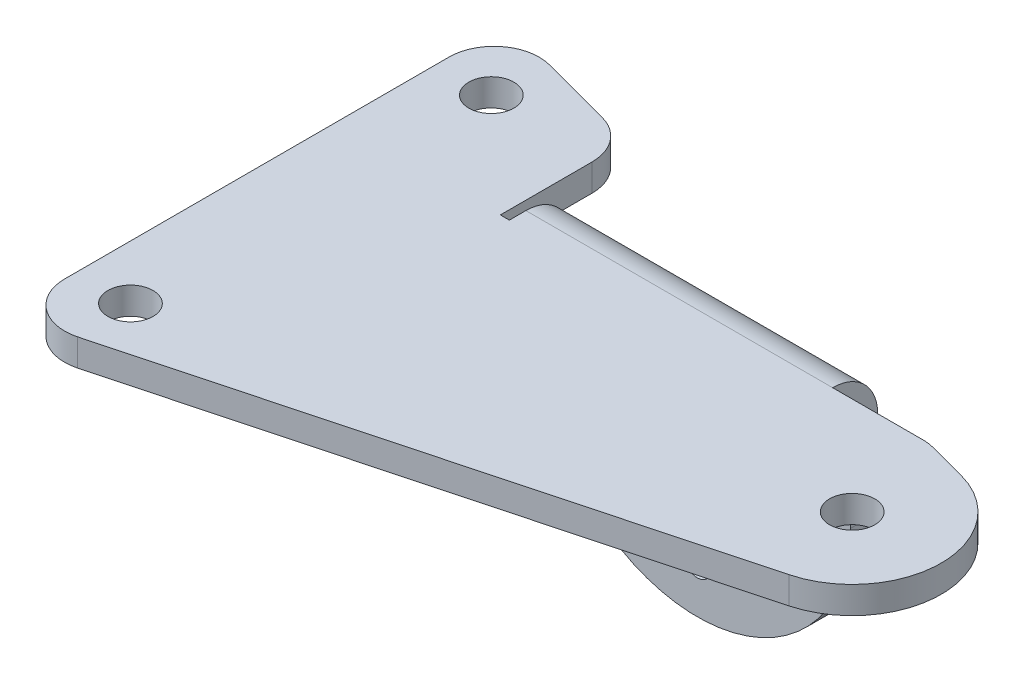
ISO-10303-21;
HEADER;
FILE_DESCRIPTION(('STEP AP214'),'2;1');
FILE_NAME('part.step','',(''),(''),'','','');
FILE_SCHEMA(('AUTOMOTIVE_DESIGN { 1 0 10303 214 1 1 1 1 }'));
ENDSEC;
DATA;
#1=APPLICATION_CONTEXT('core data for automotive mechanical design processes');
#2=APPLICATION_PROTOCOL_DEFINITION('international standard','automotive_design',2000,#1);
#3=PRODUCT_CONTEXT('',#1,'mechanical');
#4=PRODUCT('Part','Part','',(#3));
#5=PRODUCT_RELATED_PRODUCT_CATEGORY('part','',(#4));
#6=PRODUCT_DEFINITION_FORMATION('','',#4);
#7=PRODUCT_DEFINITION_CONTEXT('part definition',#1,'design');
#8=PRODUCT_DEFINITION('design','',#6,#7);
#9=PRODUCT_DEFINITION_SHAPE('','',#8);
#10=(LENGTH_UNIT() NAMED_UNIT(*) SI_UNIT(.MILLI.,.METRE.));
#11=(NAMED_UNIT(*) PLANE_ANGLE_UNIT() SI_UNIT($,.RADIAN.));
#12=(NAMED_UNIT(*) SI_UNIT($,.STERADIAN.) SOLID_ANGLE_UNIT());
#13=UNCERTAINTY_MEASURE_WITH_UNIT(LENGTH_MEASURE(1.E-05),#10,'distance_accuracy_value','');
#14=(GEOMETRIC_REPRESENTATION_CONTEXT(3) GLOBAL_UNCERTAINTY_ASSIGNED_CONTEXT((#13)) GLOBAL_UNIT_ASSIGNED_CONTEXT((#10,
#11,#12)) REPRESENTATION_CONTEXT('',''));
#15=CARTESIAN_POINT('',(0.,0.,0.));
#16=DIRECTION('',(0.,0.,1.));
#17=DIRECTION('',(1.,0.,0.));
#18=AXIS2_PLACEMENT_3D('',#15,#16,#17);
#19=CARTESIAN_POINT('',(-7.50000000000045,-30.75,-23.83));
#20=DIRECTION('',(0.,0.,1.));
#21=DIRECTION('',(1.,0.,0.));
#22=AXIS2_PLACEMENT_3D('',#19,#20,#21);
#23=CYLINDRICAL_SURFACE('',#22,1.5);
#24=CARTESIAN_POINT('',(-7.50000000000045,-30.75,-15.83));
#25=DIRECTION('',(0.,0.,1.));
#26=DIRECTION('',(1.,0.,0.));
#27=AXIS2_PLACEMENT_3D('',#24,#25,#26);
#28=CIRCLE('',#27,1.5);
#29=CARTESIAN_POINT('',(-6.00000000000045,-30.75,-15.83));
#30=VERTEX_POINT('',#29);
#31=EDGE_CURVE('E191',#30,#30,#28,.F.);
#32=ORIENTED_EDGE('',*,*,#31,.T.);
#33=EDGE_LOOP('',(#32));
#34=FACE_BOUND('',#33,.T.);
#35=CARTESIAN_POINT('',(-7.50000000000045,-30.75,-12.83));
#36=DIRECTION('',(0.,0.,1.));
#37=DIRECTION('',(1.,0.,0.));
#38=AXIS2_PLACEMENT_3D('',#35,#36,#37);
#39=CIRCLE('',#38,1.5);
#40=CARTESIAN_POINT('',(-6.00000000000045,-30.75,-12.83));
#41=VERTEX_POINT('',#40);
#42=EDGE_CURVE('E208',#41,#41,#39,.F.);
#43=ORIENTED_EDGE('',*,*,#42,.F.);
#44=EDGE_LOOP('',(#43));
#45=FACE_BOUND('',#44,.T.);
#46=ADVANCED_FACE('F17',(#34,#45),#23,.F.);
#47=CARTESIAN_POINT('',(0.249999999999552,-38.5,-23.83));
#48=DIRECTION('',(0.,0.,1.));
#49=DIRECTION('',(1.,0.,0.));
#50=AXIS2_PLACEMENT_3D('',#47,#48,#49);
#51=CYLINDRICAL_SURFACE('',#50,1.5);
#52=CARTESIAN_POINT('',(0.249999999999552,-38.5,-15.83));
#53=DIRECTION('',(0.,0.,1.));
#54=DIRECTION('',(1.,0.,0.));
#55=AXIS2_PLACEMENT_3D('',#52,#53,#54);
#56=CIRCLE('',#55,1.5);
#57=CARTESIAN_POINT('',(1.74999999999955,-38.5,-15.83));
#58=VERTEX_POINT('',#57);
#59=EDGE_CURVE('E188',#58,#58,#56,.F.);
#60=ORIENTED_EDGE('',*,*,#59,.T.);
#61=EDGE_LOOP('',(#60));
#62=FACE_BOUND('',#61,.T.);
#63=CARTESIAN_POINT('',(0.249999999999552,-38.5,-12.83));
#64=DIRECTION('',(0.,0.,1.));
#65=DIRECTION('',(1.,0.,0.));
#66=AXIS2_PLACEMENT_3D('',#63,#64,#65);
#67=CIRCLE('',#66,1.5);
#68=CARTESIAN_POINT('',(1.74999999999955,-38.5,-12.83));
#69=VERTEX_POINT('',#68);
#70=EDGE_CURVE('E206',#69,#69,#67,.F.);
#71=ORIENTED_EDGE('',*,*,#70,.F.);
#72=EDGE_LOOP('',(#71));
#73=FACE_BOUND('',#72,.T.);
#74=ADVANCED_FACE('F656',(#62,#73),#51,.F.);
#75=CARTESIAN_POINT('',(-7.50000000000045,-46.25,-23.83));
#76=DIRECTION('',(0.,0.,1.));
#77=DIRECTION('',(1.,0.,0.));
#78=AXIS2_PLACEMENT_3D('',#75,#76,#77);
#79=CYLINDRICAL_SURFACE('',#78,1.5);
#80=CARTESIAN_POINT('',(-7.50000000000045,-46.25,-15.83));
#81=DIRECTION('',(0.,0.,1.));
#82=DIRECTION('',(1.,0.,0.));
#83=AXIS2_PLACEMENT_3D('',#80,#81,#82);
#84=CIRCLE('',#83,1.5);
#85=CARTESIAN_POINT('',(-6.00000000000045,-46.25,-15.83));
#86=VERTEX_POINT('',#85);
#87=EDGE_CURVE('E185',#86,#86,#84,.F.);
#88=ORIENTED_EDGE('',*,*,#87,.T.);
#89=EDGE_LOOP('',(#88));
#90=FACE_BOUND('',#89,.T.);
#91=CARTESIAN_POINT('',(-7.50000000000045,-46.25,-12.83));
#92=DIRECTION('',(0.,0.,1.));
#93=DIRECTION('',(1.,0.,0.));
#94=AXIS2_PLACEMENT_3D('',#91,#92,#93);
#95=CIRCLE('',#94,1.5);
#96=CARTESIAN_POINT('',(-6.00000000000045,-46.25,-12.83));
#97=VERTEX_POINT('',#96);
#98=EDGE_CURVE('E203',#97,#97,#95,.F.);
#99=ORIENTED_EDGE('',*,*,#98,.F.);
#100=EDGE_LOOP('',(#99));
#101=FACE_BOUND('',#100,.T.);
#102=ADVANCED_FACE('F647',(#90,#101),#79,.F.);
#103=CARTESIAN_POINT('',(-15.2500000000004,-38.5,-23.83));
#104=DIRECTION('',(0.,0.,1.));
#105=DIRECTION('',(1.,0.,0.));
#106=AXIS2_PLACEMENT_3D('',#103,#104,#105);
#107=CYLINDRICAL_SURFACE('',#106,1.5);
#108=CARTESIAN_POINT('',(-15.2500000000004,-38.5,-15.83));
#109=DIRECTION('',(0.,0.,1.));
#110=DIRECTION('',(1.,0.,0.));
#111=AXIS2_PLACEMENT_3D('',#108,#109,#110);
#112=CIRCLE('',#111,1.5);
#113=CARTESIAN_POINT('',(-13.7500000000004,-38.5,-15.83));
#114=VERTEX_POINT('',#113);
#115=EDGE_CURVE('E182',#114,#114,#112,.F.);
#116=ORIENTED_EDGE('',*,*,#115,.T.);
#117=EDGE_LOOP('',(#116));
#118=FACE_BOUND('',#117,.T.);
#119=CARTESIAN_POINT('',(-15.2500000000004,-38.5,-12.83));
#120=DIRECTION('',(0.,0.,1.));
#121=DIRECTION('',(1.,0.,0.));
#122=AXIS2_PLACEMENT_3D('',#119,#120,#121);
#123=CIRCLE('',#122,1.5);
#124=CARTESIAN_POINT('',(-13.7500000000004,-38.5,-12.83));
#125=VERTEX_POINT('',#124);
#126=EDGE_CURVE('E200',#125,#125,#123,.F.);
#127=ORIENTED_EDGE('',*,*,#126,.F.);
#128=EDGE_LOOP('',(#127));
#129=FACE_BOUND('',#128,.T.);
#130=ADVANCED_FACE('F638',(#118,#129),#107,.F.);
#131=CARTESIAN_POINT('',(-7.50000000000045,-38.5,-23.83));
#132=DIRECTION('',(0.,0.,1.));
#133=DIRECTION('',(1.,0.,0.));
#134=AXIS2_PLACEMENT_3D('',#131,#132,#133);
#135=CYLINDRICAL_SURFACE('',#134,5.25);
#136=CARTESIAN_POINT('',(-7.50000000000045,-38.5,-15.83));
#137=DIRECTION('',(0.,0.,1.));
#138=DIRECTION('',(1.,0.,0.));
#139=AXIS2_PLACEMENT_3D('',#136,#137,#138);
#140=CIRCLE('',#139,5.25);
#141=CARTESIAN_POINT('',(-2.25000000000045,-38.5,-15.83));
#142=VERTEX_POINT('',#141);
#143=EDGE_CURVE('E179',#142,#142,#140,.F.);
#144=ORIENTED_EDGE('',*,*,#143,.T.);
#145=EDGE_LOOP('',(#144));
#146=FACE_BOUND('',#145,.T.);
#147=CARTESIAN_POINT('',(-7.50000000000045,-38.5,-12.83));
#148=DIRECTION('',(0.,0.,1.));
#149=DIRECTION('',(1.,0.,0.));
#150=AXIS2_PLACEMENT_3D('',#147,#148,#149);
#151=CIRCLE('',#150,5.25);
#152=CARTESIAN_POINT('',(-2.25000000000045,-38.5,-12.83));
#153=VERTEX_POINT('',#152);
#154=EDGE_CURVE('E197',#153,#153,#151,.F.);
#155=ORIENTED_EDGE('',*,*,#154,.F.);
#156=EDGE_LOOP('',(#155));
#157=FACE_BOUND('',#156,.T.);
#158=ADVANCED_FACE('F630',(#146,#157),#135,.F.);
#159=CARTESIAN_POINT('',(-7.50000000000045,-34.5000000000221,-12.83));
#160=DIRECTION('',(0.,0.,-1.));
#161=DIRECTION('',(0.,1.,0.));
#162=AXIS2_PLACEMENT_3D('',#159,#160,#161);
#163=CYLINDRICAL_SURFACE('',#162,16.9999999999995);
#164=DIRECTION('',(0.,0.,-1.));
#165=VECTOR('',#164,1.);
#166=CARTESIAN_POINT('',(9.4999999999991,-34.5000000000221,-12.83));
#167=LINE('',#166,#165);
#168=CARTESIAN_POINT('',(9.49999999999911,-34.500000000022,-15.83));
#169=VERTEX_POINT('',#168);
#170=CARTESIAN_POINT('',(9.49999999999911,-34.5000000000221,-12.83));
#171=VERTEX_POINT('',#170);
#172=EDGE_CURVE('E78',#169,#171,#167,.F.);
#173=ORIENTED_EDGE('',*,*,#172,.T.);
#174=CARTESIAN_POINT('',(-7.50000000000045,-34.5000000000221,-12.83));
#175=DIRECTION('',(0.,0.,-1.));
#176=DIRECTION('',(0.,1.,0.));
#177=AXIS2_PLACEMENT_3D('',#174,#175,#176);
#178=CIRCLE('',#177,16.9999999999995);
#179=CARTESIAN_POINT('',(-24.5,-34.5000000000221,-12.83));
#180=VERTEX_POINT('',#179);
#181=EDGE_CURVE('E20',#180,#171,#178,.F.);
#182=ORIENTED_EDGE('',*,*,#181,.F.);
#183=DIRECTION('',(0.,0.,-1.));
#184=VECTOR('',#183,1.);
#185=CARTESIAN_POINT('',(-24.5,-34.5000000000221,-15.83));
#186=LINE('',#185,#184);
#187=CARTESIAN_POINT('',(-24.5,-34.500000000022,-15.83));
#188=VERTEX_POINT('',#187);
#189=EDGE_CURVE('E76',#180,#188,#186,.T.);
#190=ORIENTED_EDGE('',*,*,#189,.T.);
#191=CARTESIAN_POINT('',(-7.50000000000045,-34.500000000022,-15.83));
#192=DIRECTION('',(0.,0.,-1.));
#193=DIRECTION('',(0.,1.,0.));
#194=AXIS2_PLACEMENT_3D('',#191,#192,#193);
#195=CIRCLE('',#194,16.9999999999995);
#196=EDGE_CURVE('E194',#188,#169,#195,.F.);
#197=ORIENTED_EDGE('',*,*,#196,.T.);
#198=EDGE_LOOP('',(#173,#182,#190,#197));
#199=FACE_BOUND('',#198,.T.);
#200=ADVANCED_FACE('F73',(#199),#163,.T.);
#201=CARTESIAN_POINT('',(0.,-20.,-12.83));
#202=DIRECTION('',(0.,0.,1.));
#203=DIRECTION('',(0.,-1.,0.));
#204=AXIS2_PLACEMENT_3D('',#201,#202,#203);
#205=PLANE('',#204);
#206=ORIENTED_EDGE('',*,*,#154,.T.);
#207=EDGE_LOOP('',(#206));
#208=FACE_BOUND('',#207,.T.);
#209=ORIENTED_EDGE('',*,*,#126,.T.);
#210=EDGE_LOOP('',(#209));
#211=FACE_BOUND('',#210,.T.);
#212=ORIENTED_EDGE('',*,*,#98,.T.);
#213=EDGE_LOOP('',(#212));
#214=FACE_BOUND('',#213,.T.);
#215=ORIENTED_EDGE('',*,*,#70,.T.);
#216=EDGE_LOOP('',(#215));
#217=FACE_BOUND('',#216,.T.);
#218=ORIENTED_EDGE('',*,*,#42,.T.);
#219=EDGE_LOOP('',(#218));
#220=FACE_BOUND('',#219,.T.);
#221=DIRECTION('',(0.,-1.,0.));
#222=VECTOR('',#221,1.);
#223=CARTESIAN_POINT('',(9.49999999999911,-20.,-12.83));
#224=LINE('',#223,#222);
#225=CARTESIAN_POINT('',(9.49999999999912,-25.,-12.83));
#226=VERTEX_POINT('',#225);
#227=EDGE_CURVE('E81',#171,#226,#224,.F.);
#228=ORIENTED_EDGE('',*,*,#227,.T.);
#229=DIRECTION('',(-1.,0.,0.));
#230=VECTOR('',#229,1.);
#231=CARTESIAN_POINT('',(-24.5,-25.,-12.83));
#232=LINE('',#231,#230);
#233=CARTESIAN_POINT('',(-24.5,-25.,-12.83));
#234=VERTEX_POINT('',#233);
#235=EDGE_CURVE('E88',#226,#234,#232,.T.);
#236=ORIENTED_EDGE('',*,*,#235,.T.);
#237=DIRECTION('',(0.,1.,0.));
#238=VECTOR('',#237,1.);
#239=CARTESIAN_POINT('',(-24.5,-60.,-12.83));
#240=LINE('',#239,#238);
#241=EDGE_CURVE('E84',#234,#180,#240,.F.);
#242=ORIENTED_EDGE('',*,*,#241,.T.);
#243=ORIENTED_EDGE('',*,*,#181,.T.);
#244=EDGE_LOOP('',(#228,#236,#242,#243));
#245=FACE_BOUND('',#244,.T.);
#246=ADVANCED_FACE('F85',(#208,#211,#214,#217,#220,#245),#205,.T.);
#247=CARTESIAN_POINT('',(9.49999999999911,-25.,-10.83));
#248=DIRECTION('',(1.,0.,0.));
#249=DIRECTION('',(0.,0.,-1.));
#250=AXIS2_PLACEMENT_3D('',#247,#248,#249);
#251=PLANE('',#250);
#252=CARTESIAN_POINT('',(9.49999999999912,-25.,-10.83));
#253=DIRECTION('',(-1.,0.,0.));
#254=DIRECTION('',(0.,0.,1.));
#255=AXIS2_PLACEMENT_3D('',#252,#253,#254);
#256=CIRCLE('',#255,2.);
#257=CARTESIAN_POINT('',(9.49999999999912,-23.,-10.83));
#258=VERTEX_POINT('',#257);
#259=EDGE_CURVE('E99',#258,#226,#256,.T.);
#260=ORIENTED_EDGE('',*,*,#259,.T.);
#261=ORIENTED_EDGE('',*,*,#227,.F.);
#262=ORIENTED_EDGE('',*,*,#172,.F.);
#263=DIRECTION('',(0.,-1.,0.));
#264=VECTOR('',#263,1.);
#265=CARTESIAN_POINT('',(9.49999999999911,-20.,-15.83));
#266=LINE('',#265,#264);
#267=CARTESIAN_POINT('',(9.49999999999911,-25.,-15.83));
#268=VERTEX_POINT('',#267);
#269=EDGE_CURVE('E196',#169,#268,#266,.F.);
#270=ORIENTED_EDGE('',*,*,#269,.T.);
#271=CARTESIAN_POINT('',(9.49999999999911,-25.,-10.83));
#272=DIRECTION('',(-1.,0.,0.));
#273=DIRECTION('',(0.,0.,1.));
#274=AXIS2_PLACEMENT_3D('',#271,#272,#273);
#275=CIRCLE('',#274,5.);
#276=CARTESIAN_POINT('',(9.49999999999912,-20.,-10.83));
#277=VERTEX_POINT('',#276);
#278=EDGE_CURVE('E167',#277,#268,#275,.T.);
#279=ORIENTED_EDGE('',*,*,#278,.F.);
#280=DIRECTION('',(0.,1.,0.));
#281=VECTOR('',#280,1.);
#282=CARTESIAN_POINT('',(9.49999999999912,-23.,-10.83));
#283=LINE('',#282,#281);
#284=EDGE_CURVE('E170',#258,#277,#283,.T.);
#285=ORIENTED_EDGE('',*,*,#284,.F.);
#286=EDGE_LOOP('',(#260,#261,#262,#270,#279,#285));
#287=FACE_BOUND('',#286,.T.);
#288=ADVANCED_FACE('F214',(#287),#251,.T.);
#289=CARTESIAN_POINT('',(0.,-20.,-15.83));
#290=DIRECTION('',(0.,0.,1.));
#291=DIRECTION('',(0.,-1.,0.));
#292=AXIS2_PLACEMENT_3D('',#289,#290,#291);
#293=PLANE('',#292);
#294=ORIENTED_EDGE('',*,*,#143,.F.);
#295=EDGE_LOOP('',(#294));
#296=FACE_BOUND('',#295,.T.);
#297=ORIENTED_EDGE('',*,*,#115,.F.);
#298=EDGE_LOOP('',(#297));
#299=FACE_BOUND('',#298,.T.);
#300=ORIENTED_EDGE('',*,*,#87,.F.);
#301=EDGE_LOOP('',(#300));
#302=FACE_BOUND('',#301,.T.);
#303=ORIENTED_EDGE('',*,*,#59,.F.);
#304=EDGE_LOOP('',(#303));
#305=FACE_BOUND('',#304,.T.);
#306=ORIENTED_EDGE('',*,*,#31,.F.);
#307=EDGE_LOOP('',(#306));
#308=FACE_BOUND('',#307,.T.);
#309=DIRECTION('',(0.,1.,0.));
#310=VECTOR('',#309,1.);
#311=CARTESIAN_POINT('',(-24.5,-60.,-15.83));
#312=LINE('',#311,#310);
#313=CARTESIAN_POINT('',(-24.5,-25.,-15.83));
#314=VERTEX_POINT('',#313);
#315=EDGE_CURVE('E92',#188,#314,#312,.T.);
#316=ORIENTED_EDGE('',*,*,#315,.T.);
#317=DIRECTION('',(-1.,0.,0.));
#318=VECTOR('',#317,1.);
#319=CARTESIAN_POINT('',(-24.5,-25.,-15.83));
#320=LINE('',#319,#318);
#321=EDGE_CURVE('E166',#268,#314,#320,.T.);
#322=ORIENTED_EDGE('',*,*,#321,.F.);
#323=ORIENTED_EDGE('',*,*,#269,.F.);
#324=ORIENTED_EDGE('',*,*,#196,.F.);
#325=EDGE_LOOP('',(#316,#322,#323,#324));
#326=FACE_BOUND('',#325,.T.);
#327=ADVANCED_FACE('F301',(#296,#299,#302,#305,#308,#326),#293,.F.);
#328=CARTESIAN_POINT('',(-24.5,-25.,-10.83));
#329=DIRECTION('',(-1.,0.,0.));
#330=DIRECTION('',(0.,0.,1.));
#331=AXIS2_PLACEMENT_3D('',#328,#329,#330);
#332=CYLINDRICAL_SURFACE('',#331,2.);
#333=DIRECTION('',(1.,0.,0.));
#334=VECTOR('',#333,1.);
#335=CARTESIAN_POINT('',(-38.5,-23.,-10.83));
#336=LINE('',#335,#334);
#337=CARTESIAN_POINT('',(-24.5,-23.,-10.83));
#338=VERTEX_POINT('',#337);
#339=EDGE_CURVE('E174',#258,#338,#336,.F.);
#340=ORIENTED_EDGE('',*,*,#339,.T.);
#341=CARTESIAN_POINT('',(-24.5,-25.,-10.83));
#342=DIRECTION('',(-1.,0.,0.));
#343=DIRECTION('',(0.,0.,1.));
#344=AXIS2_PLACEMENT_3D('',#341,#342,#343);
#345=CIRCLE('',#344,2.);
#346=EDGE_CURVE('E158',#338,#234,#345,.T.);
#347=ORIENTED_EDGE('',*,*,#346,.T.);
#348=ORIENTED_EDGE('',*,*,#235,.F.);
#349=ORIENTED_EDGE('',*,*,#259,.F.);
#350=EDGE_LOOP('',(#340,#347,#348,#349));
#351=FACE_BOUND('',#350,.T.);
#352=ADVANCED_FACE('F221',(#351),#332,.F.);
#353=CARTESIAN_POINT('',(-25.5,-3.,-9.));
#354=DIRECTION('',(0.,0.,1.));
#355=DIRECTION('',(1.,0.,0.));
#356=AXIS2_PLACEMENT_3D('',#353,#354,#355);
#357=PLANE('',#356);
#358=DIRECTION('',(0.,1.,0.));
#359=VECTOR('',#358,1.);
#360=CARTESIAN_POINT('',(-25.5,-3.,-9.));
#361=LINE('',#360,#359);
#362=CARTESIAN_POINT('',(-25.5,-23.,-9.));
#363=VERTEX_POINT('',#362);
#364=CARTESIAN_POINT('',(-25.5,-20.,-9.));
#365=VERTEX_POINT('',#364);
#366=EDGE_CURVE('E284',#363,#365,#361,.T.);
#367=ORIENTED_EDGE('',*,*,#366,.T.);
#368=DIRECTION('',(1.,0.,0.));
#369=VECTOR('',#368,1.);
#370=CARTESIAN_POINT('',(-25.5,-20.,-9.));
#371=LINE('',#370,#369);
#372=CARTESIAN_POINT('',(-24.5,-20.,-9.));
#373=VERTEX_POINT('',#372);
#374=EDGE_CURVE('E176',#373,#365,#371,.F.);
#375=ORIENTED_EDGE('',*,*,#374,.F.);
#376=DIRECTION('',(0.,1.,0.));
#377=VECTOR('',#376,1.);
#378=CARTESIAN_POINT('',(-24.5,-25.,-9.));
#379=LINE('',#378,#377);
#380=CARTESIAN_POINT('',(-24.5,-23.,-9.));
#381=VERTEX_POINT('',#380);
#382=EDGE_CURVE('E165',#373,#381,#379,.F.);
#383=ORIENTED_EDGE('',*,*,#382,.T.);
#384=DIRECTION('',(1.,0.,0.));
#385=VECTOR('',#384,1.);
#386=CARTESIAN_POINT('',(-38.5,-23.,-9.));
#387=LINE('',#386,#385);
#388=EDGE_CURVE('E265',#381,#363,#387,.F.);
#389=ORIENTED_EDGE('',*,*,#388,.T.);
#390=EDGE_LOOP('',(#367,#375,#383,#389));
#391=FACE_BOUND('',#390,.T.);
#392=ADVANCED_FACE('F410',(#391),#357,.F.);
#393=CARTESIAN_POINT('',(19.5,-3.,-5.83494497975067));
#394=DIRECTION('',(0.,1.,0.));
#395=DIRECTION('',(0.,0.,1.));
#396=AXIS2_PLACEMENT_3D('',#393,#394,#395);
#397=CYLINDRICAL_SURFACE('',#396,5.);
#398=CARTESIAN_POINT('',(19.5,-20.,-5.83494497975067));
#399=DIRECTION('',(0.,1.,0.));
#400=DIRECTION('',(0.,0.,1.));
#401=AXIS2_PLACEMENT_3D('',#398,#399,#400);
#402=CIRCLE('',#401,5.);
#403=CARTESIAN_POINT('',(19.2776818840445,-20.,-10.83));
#404=VERTEX_POINT('',#403);
#405=CARTESIAN_POINT('',(20.7883132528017,-20.,-10.6661196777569));
#406=VERTEX_POINT('',#405);
#407=EDGE_CURVE('E35',#404,#406,#402,.F.);
#408=ORIENTED_EDGE('',*,*,#407,.T.);
#409=DIRECTION('',(0.,1.,0.));
#410=VECTOR('',#409,1.);
#411=CARTESIAN_POINT('',(20.7883132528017,-23.,-10.6661196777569));
#412=LINE('',#411,#410);
#413=CARTESIAN_POINT('',(20.7883132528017,-23.,-10.6661196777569));
#414=VERTEX_POINT('',#413);
#415=EDGE_CURVE('E141',#406,#414,#412,.F.);
#416=ORIENTED_EDGE('',*,*,#415,.T.);
#417=CARTESIAN_POINT('',(19.5,-23.,-5.83494497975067));
#418=DIRECTION('',(0.,1.,0.));
#419=DIRECTION('',(0.,0.,1.));
#420=AXIS2_PLACEMENT_3D('',#417,#418,#419);
#421=CIRCLE('',#420,5.);
#422=CARTESIAN_POINT('',(19.2776818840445,-23.,-10.83));
#423=VERTEX_POINT('',#422);
#424=EDGE_CURVE('E171',#414,#423,#421,.T.);
#425=ORIENTED_EDGE('',*,*,#424,.T.);
#426=DIRECTION('',(0.,1.,0.));
#427=VECTOR('',#426,1.);
#428=CARTESIAN_POINT('',(19.2776818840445,-20.,-10.83));
#429=LINE('',#428,#427);
#430=EDGE_CURVE('E259',#404,#423,#429,.F.);
#431=ORIENTED_EDGE('',*,*,#430,.F.);
#432=EDGE_LOOP('',(#408,#416,#425,#431));
#433=FACE_BOUND('',#432,.T.);
#434=ADVANCED_FACE('F261',(#433),#397,.T.);
#435=CARTESIAN_POINT('',(-38.5,-23.,21.3016116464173));
#436=DIRECTION('',(0.,1.,0.));
#437=DIRECTION('',(0.,0.,1.));
#438=AXIS2_PLACEMENT_3D('',#435,#436,#437);
#439=PLANE('',#438);
#440=CARTESIAN_POINT('',(-37.5,-23.,-20.));
#441=DIRECTION('',(0.,1.,0.));
#442=DIRECTION('',(0.,0.,1.));
#443=AXIS2_PLACEMENT_3D('',#440,#441,#442);
#444=CIRCLE('',#443,2.5);
#445=CARTESIAN_POINT('',(-37.5,-23.,-17.5));
#446=VERTEX_POINT('',#445);
#447=EDGE_CURVE('E127',#446,#446,#444,.T.);
#448=ORIENTED_EDGE('',*,*,#447,.T.);
#449=EDGE_LOOP('',(#448));
#450=FACE_BOUND('',#449,.T.);
#451=CARTESIAN_POINT('',(-37.5,-23.,20.));
#452=DIRECTION('',(0.,1.,0.));
#453=DIRECTION('',(0.,0.,1.));
#454=AXIS2_PLACEMENT_3D('',#451,#452,#453);
#455=CIRCLE('',#454,2.5);
#456=CARTESIAN_POINT('',(-37.5,-23.,22.5));
#457=VERTEX_POINT('',#456);
#458=EDGE_CURVE('E131',#457,#457,#455,.T.);
#459=ORIENTED_EDGE('',*,*,#458,.T.);
#460=EDGE_LOOP('',(#459));
#461=FACE_BOUND('',#460,.T.);
#462=CARTESIAN_POINT('',(22.5,-23.,0.));
#463=DIRECTION('',(0.,1.,0.));
#464=DIRECTION('',(0.,0.,1.));
#465=AXIS2_PLACEMENT_3D('',#462,#463,#464);
#466=CIRCLE('',#465,2.5);
#467=CARTESIAN_POINT('',(22.5,-23.,2.5));
#468=VERTEX_POINT('',#467);
#469=EDGE_CURVE('E134',#468,#468,#466,.T.);
#470=ORIENTED_EDGE('',*,*,#469,.T.);
#471=EDGE_LOOP('',(#470));
#472=FACE_BOUND('',#471,.T.);
#473=CARTESIAN_POINT('',(22.5,-23.,0.));
#474=DIRECTION('',(0.,1.,0.));
#475=DIRECTION('',(0.,0.,1.));
#476=AXIS2_PLACEMENT_3D('',#473,#474,#475);
#477=CIRCLE('',#476,9.86493975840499);
#478=CARTESIAN_POINT('',(25.0418265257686,-23.,9.53184947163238));
#479=VERTEX_POINT('',#478);
#480=CARTESIAN_POINT('',(25.0418265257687,-23.,-9.53184947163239));
#481=VERTEX_POINT('',#480);
#482=EDGE_CURVE('E138',#479,#481,#477,.T.);
#483=ORIENTED_EDGE('',*,*,#482,.F.);
#484=DIRECTION('',(-0.966234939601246,0.,0.257662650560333));
#485=VECTOR('',#484,1.);
#486=CARTESIAN_POINT('',(28.91126204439,-23.,8.5));
#487=LINE('',#486,#485);
#488=CARTESIAN_POINT('',(-37.2116867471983,-23.,26.1327863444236));
#489=VERTEX_POINT('',#488);
#490=EDGE_CURVE('E146',#479,#489,#487,.T.);
#491=ORIENTED_EDGE('',*,*,#490,.T.);
#492=CARTESIAN_POINT('',(-38.5,-23.,21.3016116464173));
#493=DIRECTION('',(0.,1.,0.));
#494=DIRECTION('',(0.,0.,1.));
#495=AXIS2_PLACEMENT_3D('',#492,#493,#494);
#496=CIRCLE('',#495,5.);
#497=CARTESIAN_POINT('',(-43.5,-23.,21.3016116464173));
#498=VERTEX_POINT('',#497);
#499=EDGE_CURVE('E143',#498,#489,#496,.T.);
#500=ORIENTED_EDGE('',*,*,#499,.F.);
#501=DIRECTION('',(0.,0.,-1.));
#502=VECTOR('',#501,1.);
#503=CARTESIAN_POINT('',(-43.5,-23.,21.3016116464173));
#504=LINE('',#503,#502);
#505=CARTESIAN_POINT('',(-43.5,-23.,-21.3016116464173));
#506=VERTEX_POINT('',#505);
#507=EDGE_CURVE('E151',#498,#506,#504,.T.);
#508=ORIENTED_EDGE('',*,*,#507,.T.);
#509=CARTESIAN_POINT('',(-38.5,-23.,-21.3016116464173));
#510=DIRECTION('',(0.,1.,0.));
#511=DIRECTION('',(0.,0.,1.));
#512=AXIS2_PLACEMENT_3D('',#509,#510,#511);
#513=CIRCLE('',#512,5.);
#514=CARTESIAN_POINT('',(-37.2116867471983,-23.,-26.1327863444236));
#515=VERTEX_POINT('',#514);
#516=EDGE_CURVE('E148',#515,#506,#513,.T.);
#517=ORIENTED_EDGE('',*,*,#516,.F.);
#518=DIRECTION('',(0.966234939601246,0.,0.257662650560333));
#519=VECTOR('',#518,1.);
#520=CARTESIAN_POINT('',(-37.2116867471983,-23.,-26.1327863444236));
#521=LINE('',#520,#519);
#522=CARTESIAN_POINT('',(-29.2116867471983,-23.,-23.9994530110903));
#523=VERTEX_POINT('',#522);
#524=EDGE_CURVE('E152',#515,#523,#521,.T.);
#525=ORIENTED_EDGE('',*,*,#524,.T.);
#526=CARTESIAN_POINT('',(-30.5,-23.,-19.168278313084));
#527=DIRECTION('',(0.,-1.,0.));
#528=DIRECTION('',(0.,0.,-1.));
#529=AXIS2_PLACEMENT_3D('',#526,#527,#528);
#530=CIRCLE('',#529,5.);
#531=CARTESIAN_POINT('',(-25.5,-23.,-19.168278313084));
#532=VERTEX_POINT('',#531);
#533=EDGE_CURVE('E153',#532,#523,#530,.F.);
#534=ORIENTED_EDGE('',*,*,#533,.F.);
#535=DIRECTION('',(0.,0.,1.));
#536=VECTOR('',#535,1.);
#537=CARTESIAN_POINT('',(-25.5,-23.,-4.));
#538=LINE('',#537,#536);
#539=EDGE_CURVE('E160',#532,#363,#538,.T.);
#540=ORIENTED_EDGE('',*,*,#539,.T.);
#541=ORIENTED_EDGE('',*,*,#388,.F.);
#542=DIRECTION('',(0.,0.,-1.));
#543=VECTOR('',#542,1.);
#544=CARTESIAN_POINT('',(-24.5,-23.,-10.83));
#545=LINE('',#544,#543);
#546=EDGE_CURVE('E161',#381,#338,#545,.T.);
#547=ORIENTED_EDGE('',*,*,#546,.T.);
#548=ORIENTED_EDGE('',*,*,#339,.F.);
#549=DIRECTION('',(-1.,0.,0.));
#550=VECTOR('',#549,1.);
#551=CARTESIAN_POINT('',(11.4999999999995,-23.,-10.83));
#552=LINE('',#551,#550);
#553=EDGE_CURVE('E253',#423,#258,#552,.T.);
#554=ORIENTED_EDGE('',*,*,#553,.F.);
#555=ORIENTED_EDGE('',*,*,#424,.F.);
#556=DIRECTION('',(0.966234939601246,0.,0.257662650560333));
#557=VECTOR('',#556,1.);
#558=CARTESIAN_POINT('',(-37.2116867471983,-23.,-26.1327863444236));
#559=LINE('',#558,#557);
#560=EDGE_CURVE('E271',#414,#481,#559,.T.);
#561=ORIENTED_EDGE('',*,*,#560,.T.);
#562=EDGE_LOOP('',(#483,#491,#500,#508,#517,#525,#534,#540,#541,#547,#548,#554,#555,#561));
#563=FACE_BOUND('',#562,.T.);
#564=ADVANCED_FACE('F255',(#450,#461,#472,#563),#439,.F.);
#565=CARTESIAN_POINT('',(11.4999999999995,-23.,-10.83));
#566=DIRECTION('',(0.,0.,-1.));
#567=DIRECTION('',(-1.,0.,0.));
#568=AXIS2_PLACEMENT_3D('',#565,#566,#567);
#569=PLANE('',#568);
#570=ORIENTED_EDGE('',*,*,#284,.T.);
#571=DIRECTION('',(1.,0.,0.));
#572=VECTOR('',#571,1.);
#573=CARTESIAN_POINT('',(-38.5,-20.,-10.83));
#574=LINE('',#573,#572);
#575=EDGE_CURVE('E130',#404,#277,#574,.F.);
#576=ORIENTED_EDGE('',*,*,#575,.F.);
#577=ORIENTED_EDGE('',*,*,#430,.T.);
#578=ORIENTED_EDGE('',*,*,#553,.T.);
#579=EDGE_LOOP('',(#570,#576,#577,#578));
#580=FACE_BOUND('',#579,.T.);
#581=ADVANCED_FACE('F264',(#580),#569,.T.);
#582=CARTESIAN_POINT('',(-24.5,-25.,-10.83));
#583=DIRECTION('',(-1.,0.,0.));
#584=DIRECTION('',(0.,0.,1.));
#585=AXIS2_PLACEMENT_3D('',#582,#583,#584);
#586=CYLINDRICAL_SURFACE('',#585,5.);
#587=ORIENTED_EDGE('',*,*,#321,.T.);
#588=CARTESIAN_POINT('',(-24.5,-25.,-10.83));
#589=DIRECTION('',(-1.,0.,0.));
#590=DIRECTION('',(0.,0.,1.));
#591=AXIS2_PLACEMENT_3D('',#588,#589,#590);
#592=CIRCLE('',#591,5.);
#593=CARTESIAN_POINT('',(-24.5,-20.,-10.83));
#594=VERTEX_POINT('',#593);
#595=EDGE_CURVE('E162',#314,#594,#592,.F.);
#596=ORIENTED_EDGE('',*,*,#595,.T.);
#597=DIRECTION('',(1.,0.,0.));
#598=VECTOR('',#597,1.);
#599=CARTESIAN_POINT('',(-38.5,-20.,-10.83));
#600=LINE('',#599,#598);
#601=EDGE_CURVE('E306',#277,#594,#600,.F.);
#602=ORIENTED_EDGE('',*,*,#601,.F.);
#603=ORIENTED_EDGE('',*,*,#278,.T.);
#604=EDGE_LOOP('',(#587,#596,#602,#603));
#605=FACE_BOUND('',#604,.T.);
#606=ADVANCED_FACE('F304',(#605),#586,.T.);
#607=CARTESIAN_POINT('',(-24.5,-25.,-10.83));
#608=DIRECTION('',(1.,0.,0.));
#609=DIRECTION('',(0.,0.,-1.));
#610=AXIS2_PLACEMENT_3D('',#607,#608,#609);
#611=PLANE('',#610);
#612=ORIENTED_EDGE('',*,*,#546,.F.);
#613=ORIENTED_EDGE('',*,*,#382,.F.);
#614=DIRECTION('',(0.,0.,1.));
#615=VECTOR('',#614,1.);
#616=CARTESIAN_POINT('',(-24.5,-20.,21.3016116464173));
#617=LINE('',#616,#615);
#618=EDGE_CURVE('E310',#594,#373,#617,.T.);
#619=ORIENTED_EDGE('',*,*,#618,.F.);
#620=ORIENTED_EDGE('',*,*,#595,.F.);
#621=ORIENTED_EDGE('',*,*,#315,.F.);
#622=ORIENTED_EDGE('',*,*,#189,.F.);
#623=ORIENTED_EDGE('',*,*,#241,.F.);
#624=ORIENTED_EDGE('',*,*,#346,.F.);
#625=EDGE_LOOP('',(#612,#613,#619,#620,#621,#622,#623,#624));
#626=FACE_BOUND('',#625,.T.);
#627=ADVANCED_FACE('F95',(#626),#611,.F.);
#628=CARTESIAN_POINT('',(-25.5,-3.,-4.));
#629=DIRECTION('',(-1.,0.,0.));
#630=DIRECTION('',(0.,0.,1.));
#631=AXIS2_PLACEMENT_3D('',#628,#629,#630);
#632=PLANE('',#631);
#633=ORIENTED_EDGE('',*,*,#366,.F.);
#634=ORIENTED_EDGE('',*,*,#539,.F.);
#635=DIRECTION('',(0.,-1.,0.));
#636=VECTOR('',#635,1.);
#637=CARTESIAN_POINT('',(-25.5,-3.,-19.168278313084));
#638=LINE('',#637,#636);
#639=CARTESIAN_POINT('',(-25.5,-20.,-19.168278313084));
#640=VERTEX_POINT('',#639);
#641=EDGE_CURVE('E157',#640,#532,#638,.T.);
#642=ORIENTED_EDGE('',*,*,#641,.F.);
#643=DIRECTION('',(0.,0.,1.));
#644=VECTOR('',#643,1.);
#645=CARTESIAN_POINT('',(-25.5,-20.,21.3016116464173));
#646=LINE('',#645,#644);
#647=EDGE_CURVE('E126',#365,#640,#646,.F.);
#648=ORIENTED_EDGE('',*,*,#647,.F.);
#649=EDGE_LOOP('',(#633,#634,#642,#648));
#650=FACE_BOUND('',#649,.T.);
#651=ADVANCED_FACE('F409',(#650),#632,.F.);
#652=CARTESIAN_POINT('',(-30.5,-3.,-19.168278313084));
#653=DIRECTION('',(0.,-1.,0.));
#654=DIRECTION('',(0.,0.,-1.));
#655=AXIS2_PLACEMENT_3D('',#652,#653,#654);
#656=CYLINDRICAL_SURFACE('',#655,5.);
#657=ORIENTED_EDGE('',*,*,#533,.T.);
#658=DIRECTION('',(0.,1.,0.));
#659=VECTOR('',#658,1.);
#660=CARTESIAN_POINT('',(-29.2116867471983,-23.,-23.9994530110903));
#661=LINE('',#660,#659);
#662=CARTESIAN_POINT('',(-29.2116867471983,-20.,-23.9994530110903));
#663=VERTEX_POINT('',#662);
#664=EDGE_CURVE('E156',#523,#663,#661,.T.);
#665=ORIENTED_EDGE('',*,*,#664,.T.);
#666=CARTESIAN_POINT('',(-30.5,-20.,-19.168278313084));
#667=DIRECTION('',(0.,-1.,0.));
#668=DIRECTION('',(0.,0.,-1.));
#669=AXIS2_PLACEMENT_3D('',#666,#667,#668);
#670=CIRCLE('',#669,5.);
#671=EDGE_CURVE('E123',#640,#663,#670,.F.);
#672=ORIENTED_EDGE('',*,*,#671,.F.);
#673=ORIENTED_EDGE('',*,*,#641,.T.);
#674=EDGE_LOOP('',(#657,#665,#672,#673));
#675=FACE_BOUND('',#674,.T.);
#676=ADVANCED_FACE('F400',(#675),#656,.T.);
#677=CARTESIAN_POINT('',(-37.2116867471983,-23.,-26.1327863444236));
#678=DIRECTION('',(-0.257662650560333,0.,0.966234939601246));
#679=DIRECTION('',(0.966234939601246,0.,0.257662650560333));
#680=AXIS2_PLACEMENT_3D('',#677,#678,#679);
#681=PLANE('',#680);
#682=DIRECTION('',(0.,1.,0.));
#683=VECTOR('',#682,1.);
#684=CARTESIAN_POINT('',(-37.2116867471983,-23.,-26.1327863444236));
#685=LINE('',#684,#683);
#686=CARTESIAN_POINT('',(-37.2116867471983,-20.,-26.1327863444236));
#687=VERTEX_POINT('',#686);
#688=EDGE_CURVE('E281',#687,#515,#685,.F.);
#689=ORIENTED_EDGE('',*,*,#688,.F.);
#690=DIRECTION('',(-0.966234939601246,0.,-0.257662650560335));
#691=VECTOR('',#690,1.);
#692=CARTESIAN_POINT('',(-29.2116867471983,-20.,-23.9994530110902));
#693=LINE('',#692,#691);
#694=EDGE_CURVE('E122',#663,#687,#693,.T.);
#695=ORIENTED_EDGE('',*,*,#694,.F.);
#696=ORIENTED_EDGE('',*,*,#664,.F.);
#697=ORIENTED_EDGE('',*,*,#524,.F.);
#698=EDGE_LOOP('',(#689,#695,#696,#697));
#699=FACE_BOUND('',#698,.T.);
#700=ADVANCED_FACE('F407',(#699),#681,.F.);
#701=CARTESIAN_POINT('',(-38.5,-23.,-21.3016116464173));
#702=DIRECTION('',(0.,1.,0.));
#703=DIRECTION('',(0.,0.,1.));
#704=AXIS2_PLACEMENT_3D('',#701,#702,#703);
#705=CYLINDRICAL_SURFACE('',#704,5.);
#706=DIRECTION('',(0.,1.,0.));
#707=VECTOR('',#706,1.);
#708=CARTESIAN_POINT('',(-43.5,-23.,-21.3016116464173));
#709=LINE('',#708,#707);
#710=CARTESIAN_POINT('',(-43.5,-20.,-21.3016116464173));
#711=VERTEX_POINT('',#710);
#712=EDGE_CURVE('E278',#506,#711,#709,.T.);
#713=ORIENTED_EDGE('',*,*,#712,.T.);
#714=CARTESIAN_POINT('',(-38.5,-20.,-21.3016116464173));
#715=DIRECTION('',(0.,1.,0.));
#716=DIRECTION('',(0.,0.,1.));
#717=AXIS2_PLACEMENT_3D('',#714,#715,#716);
#718=CIRCLE('',#717,5.);
#719=EDGE_CURVE('E119',#687,#711,#718,.T.);
#720=ORIENTED_EDGE('',*,*,#719,.F.);
#721=ORIENTED_EDGE('',*,*,#688,.T.);
#722=ORIENTED_EDGE('',*,*,#516,.T.);
#723=EDGE_LOOP('',(#713,#720,#721,#722));
#724=FACE_BOUND('',#723,.T.);
#725=ADVANCED_FACE('F452',(#724),#705,.T.);
#726=CARTESIAN_POINT('',(-43.5,-23.,21.3016116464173));
#727=DIRECTION('',(1.,0.,0.));
#728=DIRECTION('',(0.,0.,-1.));
#729=AXIS2_PLACEMENT_3D('',#726,#727,#728);
#730=PLANE('',#729);
#731=ORIENTED_EDGE('',*,*,#507,.F.);
#732=DIRECTION('',(0.,1.,0.));
#733=VECTOR('',#732,1.);
#734=CARTESIAN_POINT('',(-43.5,-23.,21.3016116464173));
#735=LINE('',#734,#733);
#736=CARTESIAN_POINT('',(-43.5,-20.,21.3016116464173));
#737=VERTEX_POINT('',#736);
#738=EDGE_CURVE('E147',#737,#498,#735,.F.);
#739=ORIENTED_EDGE('',*,*,#738,.F.);
#740=DIRECTION('',(0.,0.,1.));
#741=VECTOR('',#740,1.);
#742=CARTESIAN_POINT('',(-43.5,-20.,21.3016116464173));
#743=LINE('',#742,#741);
#744=EDGE_CURVE('E118',#711,#737,#743,.T.);
#745=ORIENTED_EDGE('',*,*,#744,.F.);
#746=ORIENTED_EDGE('',*,*,#712,.F.);
#747=EDGE_LOOP('',(#731,#739,#745,#746));
#748=FACE_BOUND('',#747,.T.);
#749=ADVANCED_FACE('F448',(#748),#730,.F.);
#750=CARTESIAN_POINT('',(-38.5,-23.,21.3016116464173));
#751=DIRECTION('',(0.,1.,0.));
#752=DIRECTION('',(0.,0.,1.));
#753=AXIS2_PLACEMENT_3D('',#750,#751,#752);
#754=CYLINDRICAL_SURFACE('',#753,5.);
#755=DIRECTION('',(0.,1.,0.));
#756=VECTOR('',#755,1.);
#757=CARTESIAN_POINT('',(-37.2116867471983,-23.,26.1327863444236));
#758=LINE('',#757,#756);
#759=CARTESIAN_POINT('',(-37.2116867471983,-20.,26.1327863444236));
#760=VERTEX_POINT('',#759);
#761=EDGE_CURVE('E275',#489,#760,#758,.T.);
#762=ORIENTED_EDGE('',*,*,#761,.T.);
#763=CARTESIAN_POINT('',(-38.5,-20.,21.3016116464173));
#764=DIRECTION('',(0.,1.,0.));
#765=DIRECTION('',(0.,0.,1.));
#766=AXIS2_PLACEMENT_3D('',#763,#764,#765);
#767=CIRCLE('',#766,5.);
#768=EDGE_CURVE('E115',#737,#760,#767,.T.);
#769=ORIENTED_EDGE('',*,*,#768,.F.);
#770=ORIENTED_EDGE('',*,*,#738,.T.);
#771=ORIENTED_EDGE('',*,*,#499,.T.);
#772=EDGE_LOOP('',(#762,#769,#770,#771));
#773=FACE_BOUND('',#772,.T.);
#774=ADVANCED_FACE('F445',(#773),#754,.T.);
#775=CARTESIAN_POINT('',(28.91126204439,-23.,8.5));
#776=DIRECTION('',(-0.257662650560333,0.,-0.966234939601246));
#777=DIRECTION('',(-0.966234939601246,0.,0.257662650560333));
#778=AXIS2_PLACEMENT_3D('',#775,#776,#777);
#779=PLANE('',#778);
#780=ORIENTED_EDGE('',*,*,#490,.F.);
#781=DIRECTION('',(0.,1.,0.));
#782=VECTOR('',#781,1.);
#783=CARTESIAN_POINT('',(25.0418265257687,-23.,9.53184947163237));
#784=LINE('',#783,#782);
#785=CARTESIAN_POINT('',(25.0418265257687,-20.,9.53184947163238));
#786=VERTEX_POINT('',#785);
#787=EDGE_CURVE('E142',#786,#479,#784,.F.);
#788=ORIENTED_EDGE('',*,*,#787,.F.);
#789=DIRECTION('',(0.966234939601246,0.,-0.257662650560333));
#790=VECTOR('',#789,1.);
#791=CARTESIAN_POINT('',(-37.2116867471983,-20.,26.1327863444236));
#792=LINE('',#791,#790);
#793=EDGE_CURVE('E114',#760,#786,#792,.T.);
#794=ORIENTED_EDGE('',*,*,#793,.F.);
#795=ORIENTED_EDGE('',*,*,#761,.F.);
#796=EDGE_LOOP('',(#780,#788,#794,#795));
#797=FACE_BOUND('',#796,.T.);
#798=ADVANCED_FACE('F374',(#797),#779,.F.);
#799=CARTESIAN_POINT('',(22.5,-23.,0.));
#800=DIRECTION('',(0.,1.,0.));
#801=DIRECTION('',(0.,0.,1.));
#802=AXIS2_PLACEMENT_3D('',#799,#800,#801);
#803=CYLINDRICAL_SURFACE('',#802,9.86493975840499);
#804=DIRECTION('',(0.,1.,0.));
#805=VECTOR('',#804,1.);
#806=CARTESIAN_POINT('',(25.0418265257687,-23.,-9.53184947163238));
#807=LINE('',#806,#805);
#808=CARTESIAN_POINT('',(25.0418265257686,-20.,-9.53184947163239));
#809=VERTEX_POINT('',#808);
#810=EDGE_CURVE('E137',#481,#809,#807,.T.);
#811=ORIENTED_EDGE('',*,*,#810,.T.);
#812=CARTESIAN_POINT('',(22.5,-20.,0.));
#813=DIRECTION('',(0.,1.,0.));
#814=DIRECTION('',(0.,0.,1.));
#815=AXIS2_PLACEMENT_3D('',#812,#813,#814);
#816=CIRCLE('',#815,9.86493975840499);
#817=EDGE_CURVE('E111',#786,#809,#816,.T.);
#818=ORIENTED_EDGE('',*,*,#817,.F.);
#819=ORIENTED_EDGE('',*,*,#787,.T.);
#820=ORIENTED_EDGE('',*,*,#482,.T.);
#821=EDGE_LOOP('',(#811,#818,#819,#820));
#822=FACE_BOUND('',#821,.T.);
#823=ADVANCED_FACE('F367',(#822),#803,.T.);
#824=CARTESIAN_POINT('',(-37.2116867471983,-23.,-26.1327863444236));
#825=DIRECTION('',(-0.257662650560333,0.,0.966234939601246));
#826=DIRECTION('',(0.966234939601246,0.,0.257662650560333));
#827=AXIS2_PLACEMENT_3D('',#824,#825,#826);
#828=PLANE('',#827);
#829=ORIENTED_EDGE('',*,*,#810,.F.);
#830=ORIENTED_EDGE('',*,*,#560,.F.);
#831=ORIENTED_EDGE('',*,*,#415,.F.);
#832=DIRECTION('',(-0.966234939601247,0.,-0.25766265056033));
#833=VECTOR('',#832,1.);
#834=CARTESIAN_POINT('',(25.0418265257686,-20.,-9.53184947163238));
#835=LINE('',#834,#833);
#836=EDGE_CURVE('E110',#809,#406,#835,.T.);
#837=ORIENTED_EDGE('',*,*,#836,.F.);
#838=EDGE_LOOP('',(#829,#830,#831,#837));
#839=FACE_BOUND('',#838,.T.);
#840=ADVANCED_FACE('F363',(#839),#828,.F.);
#841=CARTESIAN_POINT('',(22.5,-23.,0.));
#842=DIRECTION('',(0.,1.,0.));
#843=DIRECTION('',(0.,0.,1.));
#844=AXIS2_PLACEMENT_3D('',#841,#842,#843);
#845=CYLINDRICAL_SURFACE('',#844,2.5);
#846=CARTESIAN_POINT('',(22.5,-20.,0.));
#847=DIRECTION('',(0.,1.,0.));
#848=DIRECTION('',(0.,0.,1.));
#849=AXIS2_PLACEMENT_3D('',#846,#847,#848);
#850=CIRCLE('',#849,2.5);
#851=CARTESIAN_POINT('',(22.5,-20.,2.5));
#852=VERTEX_POINT('',#851);
#853=EDGE_CURVE('E107',#852,#852,#850,.F.);
#854=ORIENTED_EDGE('',*,*,#853,.F.);
#855=EDGE_LOOP('',(#854));
#856=FACE_BOUND('',#855,.T.);
#857=ORIENTED_EDGE('',*,*,#469,.F.);
#858=EDGE_LOOP('',(#857));
#859=FACE_BOUND('',#858,.T.);
#860=ADVANCED_FACE('F434',(#856,#859),#845,.F.);
#861=CARTESIAN_POINT('',(-37.5,-23.,20.));
#862=DIRECTION('',(0.,1.,0.));
#863=DIRECTION('',(0.,0.,1.));
#864=AXIS2_PLACEMENT_3D('',#861,#862,#863);
#865=CYLINDRICAL_SURFACE('',#864,2.5);
#866=CARTESIAN_POINT('',(-37.5,-20.,20.));
#867=DIRECTION('',(0.,1.,0.));
#868=DIRECTION('',(0.,0.,1.));
#869=AXIS2_PLACEMENT_3D('',#866,#867,#868);
#870=CIRCLE('',#869,2.5);
#871=CARTESIAN_POINT('',(-37.5,-20.,22.5));
#872=VERTEX_POINT('',#871);
#873=EDGE_CURVE('E26',#872,#872,#870,.F.);
#874=ORIENTED_EDGE('',*,*,#873,.F.);
#875=EDGE_LOOP('',(#874));
#876=FACE_BOUND('',#875,.T.);
#877=ORIENTED_EDGE('',*,*,#458,.F.);
#878=EDGE_LOOP('',(#877));
#879=FACE_BOUND('',#878,.T.);
#880=ADVANCED_FACE('F427',(#876,#879),#865,.F.);
#881=CARTESIAN_POINT('',(-37.5,-23.,-20.));
#882=DIRECTION('',(0.,1.,0.));
#883=DIRECTION('',(0.,0.,1.));
#884=AXIS2_PLACEMENT_3D('',#881,#882,#883);
#885=CYLINDRICAL_SURFACE('',#884,2.5);
#886=CARTESIAN_POINT('',(-37.5,-20.,-20.));
#887=DIRECTION('',(0.,1.,0.));
#888=DIRECTION('',(0.,0.,1.));
#889=AXIS2_PLACEMENT_3D('',#886,#887,#888);
#890=CIRCLE('',#889,2.5);
#891=CARTESIAN_POINT('',(-37.5,-20.,-17.5));
#892=VERTEX_POINT('',#891);
#893=EDGE_CURVE('E11',#892,#892,#890,.F.);
#894=ORIENTED_EDGE('',*,*,#893,.F.);
#895=EDGE_LOOP('',(#894));
#896=FACE_BOUND('',#895,.T.);
#897=ORIENTED_EDGE('',*,*,#447,.F.);
#898=EDGE_LOOP('',(#897));
#899=FACE_BOUND('',#898,.T.);
#900=ADVANCED_FACE('F421',(#896,#899),#885,.F.);
#901=CARTESIAN_POINT('',(-38.5,-20.,21.3016116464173));
#902=DIRECTION('',(0.,1.,0.));
#903=DIRECTION('',(0.,0.,1.));
#904=AXIS2_PLACEMENT_3D('',#901,#902,#903);
#905=PLANE('',#904);
#906=ORIENTED_EDGE('',*,*,#893,.T.);
#907=EDGE_LOOP('',(#906));
#908=FACE_BOUND('',#907,.T.);
#909=ORIENTED_EDGE('',*,*,#873,.T.);
#910=EDGE_LOOP('',(#909));
#911=FACE_BOUND('',#910,.T.);
#912=ORIENTED_EDGE('',*,*,#853,.T.);
#913=EDGE_LOOP('',(#912));
#914=FACE_BOUND('',#913,.T.);
#915=ORIENTED_EDGE('',*,*,#407,.F.);
#916=ORIENTED_EDGE('',*,*,#575,.T.);
#917=ORIENTED_EDGE('',*,*,#601,.T.);
#918=ORIENTED_EDGE('',*,*,#618,.T.);
#919=ORIENTED_EDGE('',*,*,#374,.T.);
#920=ORIENTED_EDGE('',*,*,#647,.T.);
#921=ORIENTED_EDGE('',*,*,#671,.T.);
#922=ORIENTED_EDGE('',*,*,#694,.T.);
#923=ORIENTED_EDGE('',*,*,#719,.T.);
#924=ORIENTED_EDGE('',*,*,#744,.T.);
#925=ORIENTED_EDGE('',*,*,#768,.T.);
#926=ORIENTED_EDGE('',*,*,#793,.T.);
#927=ORIENTED_EDGE('',*,*,#817,.T.);
#928=ORIENTED_EDGE('',*,*,#836,.T.);
#929=EDGE_LOOP('',(#915,#916,#917,#918,#919,#920,#921,#922,#923,#924,#925,#926,#927,#928));
#930=FACE_BOUND('',#929,.T.);
#931=ADVANCED_FACE('F359',(#908,#911,#914,#930),#905,.T.);
#932=CLOSED_SHELL('',(#46,#74,#102,#130,#158,#200,#246,#288,#327,#352,#392,#434,#564,#581,#606,
#627,#651,#676,#700,#725,#749,#774,#798,#823,#840,#860,#880,#900,#931));
#933=MANIFOLD_SOLID_BREP('B1',#932);
#934=ADVANCED_BREP_SHAPE_REPRESENTATION('',(#18,#933),#14);
#935=SHAPE_DEFINITION_REPRESENTATION(#9,#934);
ENDSEC;
END-ISO-10303-21;
